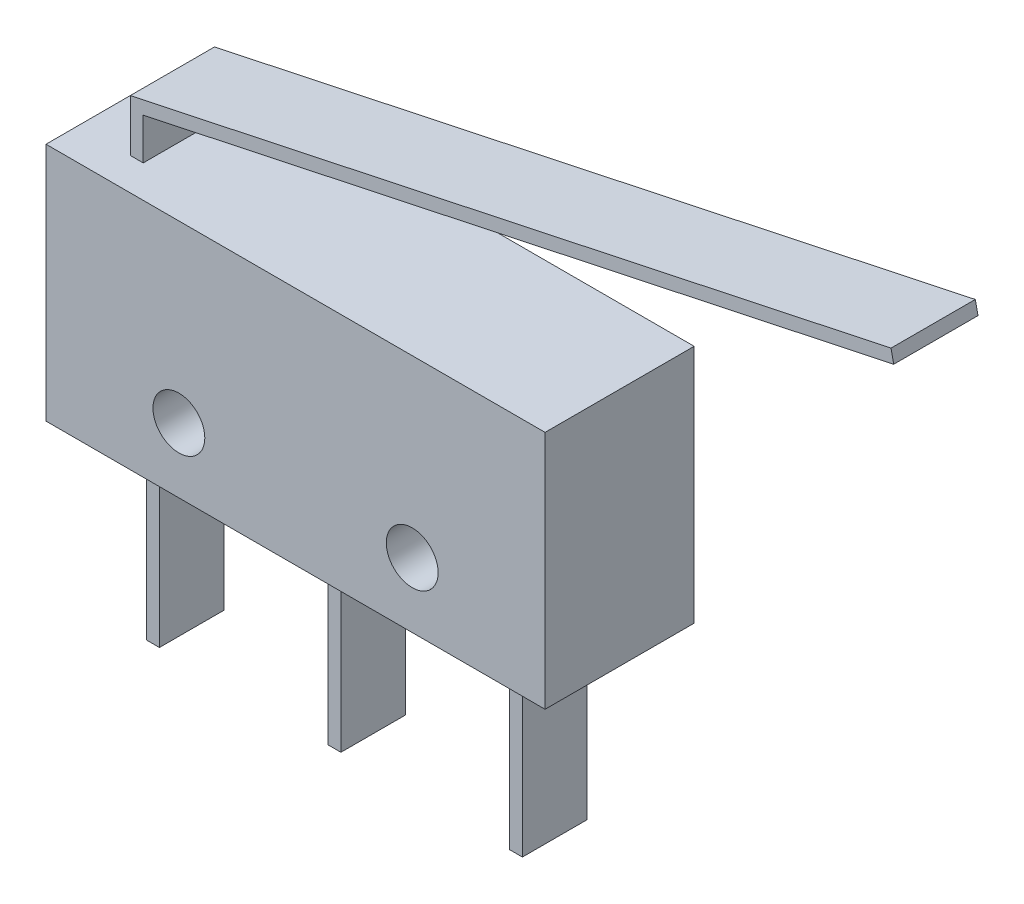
ISO-10303-21;
HEADER;
FILE_DESCRIPTION(('STEP AP214'),'2;1');
FILE_NAME('part.step','',(''),(''),'','','');
FILE_SCHEMA(('AUTOMOTIVE_DESIGN { 1 0 10303 214 1 1 1 1 }'));
ENDSEC;
DATA;
#1=APPLICATION_CONTEXT('core data for automotive mechanical design processes');
#2=APPLICATION_PROTOCOL_DEFINITION('international standard','automotive_design',2000,#1);
#3=PRODUCT_CONTEXT('',#1,'mechanical');
#4=PRODUCT('Part','Part','',(#3));
#5=PRODUCT_RELATED_PRODUCT_CATEGORY('part','',(#4));
#6=PRODUCT_DEFINITION_FORMATION('','',#4);
#7=PRODUCT_DEFINITION_CONTEXT('part definition',#1,'design');
#8=PRODUCT_DEFINITION('design','',#6,#7);
#9=PRODUCT_DEFINITION_SHAPE('','',#8);
#10=(LENGTH_UNIT() NAMED_UNIT(*) SI_UNIT(.MILLI.,.METRE.));
#11=(NAMED_UNIT(*) PLANE_ANGLE_UNIT() SI_UNIT($,.RADIAN.));
#12=(NAMED_UNIT(*) SI_UNIT($,.STERADIAN.) SOLID_ANGLE_UNIT());
#13=UNCERTAINTY_MEASURE_WITH_UNIT(LENGTH_MEASURE(1.E-05),#10,'distance_accuracy_value','');
#14=(GEOMETRIC_REPRESENTATION_CONTEXT(3) GLOBAL_UNCERTAINTY_ASSIGNED_CONTEXT((#13)) GLOBAL_UNIT_ASSIGNED_CONTEXT((#10,
#11,#12)) REPRESENTATION_CONTEXT('',''));
#15=CARTESIAN_POINT('',(0.,0.,0.));
#16=DIRECTION('',(0.,0.,1.));
#17=DIRECTION('',(1.,0.,0.));
#18=AXIS2_PLACEMENT_3D('',#15,#16,#17);
#19=CARTESIAN_POINT('',(-7.64138086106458,6.23410101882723,1.651));
#20=DIRECTION('',(-0.207911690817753,0.978147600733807,0.));
#21=DIRECTION('',(-0.978147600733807,-0.207911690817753,0.));
#22=AXIS2_PLACEMENT_3D('',#19,#20,#21);
#23=PLANE('',#22);
#24=DIRECTION('',(0.978147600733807,0.207911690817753,0.));
#25=VECTOR('',#24,1.);
#26=CARTESIAN_POINT('',(-7.64138086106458,6.23410101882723,-1.651));
#27=LINE('',#26,#25);
#28=CARTESIAN_POINT('',(-7.239,6.31962971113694,-1.651));
#29=VERTEX_POINT('',#28);
#30=CARTESIAN_POINT('',(22.1725580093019,12.5712493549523,-1.651));
#31=VERTEX_POINT('',#30);
#32=EDGE_CURVE('E124',#29,#31,#27,.T.);
#33=ORIENTED_EDGE('',*,*,#32,.T.);
#34=DIRECTION('',(0.,0.,-1.));
#35=VECTOR('',#34,1.);
#36=CARTESIAN_POINT('',(22.1725580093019,12.5712493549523,1.651));
#37=LINE('',#36,#35);
#38=CARTESIAN_POINT('',(22.1725580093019,12.5712493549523,1.651));
#39=VERTEX_POINT('',#38);
#40=EDGE_CURVE('E12',#39,#31,#37,.T.);
#41=ORIENTED_EDGE('',*,*,#40,.F.);
#42=DIRECTION('',(0.978147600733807,0.207911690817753,0.));
#43=VECTOR('',#42,1.);
#44=CARTESIAN_POINT('',(-7.64138086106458,6.23410101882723,1.651));
#45=LINE('',#44,#43);
#46=CARTESIAN_POINT('',(-7.239,6.31962971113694,1.651));
#47=VERTEX_POINT('',#46);
#48=EDGE_CURVE('E89',#47,#39,#45,.T.);
#49=ORIENTED_EDGE('',*,*,#48,.F.);
#50=DIRECTION('',(0.,0.,-1.));
#51=VECTOR('',#50,1.);
#52=CARTESIAN_POINT('',(-7.239,6.31962971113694,1.651));
#53=LINE('',#52,#51);
#54=EDGE_CURVE('E120',#47,#29,#53,.T.);
#55=ORIENTED_EDGE('',*,*,#54,.T.);
#56=EDGE_LOOP('',(#33,#41,#49,#55));
#57=FACE_BOUND('',#56,.T.);
#58=ADVANCED_FACE('F43',(#57),#23,.F.);
#59=CARTESIAN_POINT('',(22.0669388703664,13.0681483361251,1.651));
#60=DIRECTION('',(0.978147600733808,0.207911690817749,0.));
#61=DIRECTION('',(-0.207911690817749,0.978147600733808,0.));
#62=AXIS2_PLACEMENT_3D('',#59,#60,#61);
#63=PLANE('',#62);
#64=DIRECTION('',(0.207911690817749,-0.978147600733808,0.));
#65=VECTOR('',#64,1.);
#66=CARTESIAN_POINT('',(22.0669388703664,13.0681483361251,-1.651));
#67=LINE('',#66,#65);
#68=CARTESIAN_POINT('',(22.0669388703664,13.0681483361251,-1.651));
#69=VERTEX_POINT('',#68);
#70=EDGE_CURVE('E127',#69,#31,#67,.T.);
#71=ORIENTED_EDGE('',*,*,#70,.F.);
#72=DIRECTION('',(0.,0.,-1.));
#73=VECTOR('',#72,1.);
#74=CARTESIAN_POINT('',(22.0669388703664,13.0681483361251,1.651));
#75=LINE('',#74,#73);
#76=CARTESIAN_POINT('',(22.0669388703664,13.0681483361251,1.651));
#77=VERTEX_POINT('',#76);
#78=EDGE_CURVE('E51',#77,#69,#75,.T.);
#79=ORIENTED_EDGE('',*,*,#78,.F.);
#80=DIRECTION('',(0.207911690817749,-0.978147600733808,0.));
#81=VECTOR('',#80,1.);
#82=CARTESIAN_POINT('',(22.0669388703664,13.0681483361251,1.651));
#83=LINE('',#82,#81);
#84=EDGE_CURVE('E213',#77,#39,#83,.T.);
#85=ORIENTED_EDGE('',*,*,#84,.T.);
#86=ORIENTED_EDGE('',*,*,#40,.T.);
#87=EDGE_LOOP('',(#71,#79,#85,#86));
#88=FACE_BOUND('',#87,.T.);
#89=ADVANCED_FACE('F145',(#88),#63,.T.);
#90=CARTESIAN_POINT('',(-7.747,6.731,1.651));
#91=DIRECTION('',(-0.207911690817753,0.978147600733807,0.));
#92=DIRECTION('',(-0.978147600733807,-0.207911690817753,0.));
#93=AXIS2_PLACEMENT_3D('',#90,#91,#92);
#94=PLANE('',#93);
#95=DIRECTION('',(0.978147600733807,0.207911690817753,0.));
#96=VECTOR('',#95,1.);
#97=CARTESIAN_POINT('',(-7.747,6.731,-1.651));
#98=LINE('',#97,#96);
#99=CARTESIAN_POINT('',(-7.747,6.731,-1.651));
#100=VERTEX_POINT('',#99);
#101=EDGE_CURVE('E130',#100,#69,#98,.T.);
#102=ORIENTED_EDGE('',*,*,#101,.F.);
#103=DIRECTION('',(0.,0.,-1.));
#104=VECTOR('',#103,1.);
#105=CARTESIAN_POINT('',(-7.747,6.731,1.651));
#106=LINE('',#105,#104);
#107=CARTESIAN_POINT('',(-7.747,6.731,1.651));
#108=VERTEX_POINT('',#107);
#109=EDGE_CURVE('E110',#108,#100,#106,.T.);
#110=ORIENTED_EDGE('',*,*,#109,.F.);
#111=DIRECTION('',(0.978147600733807,0.207911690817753,0.));
#112=VECTOR('',#111,1.);
#113=CARTESIAN_POINT('',(-7.747,6.731,1.651));
#114=LINE('',#113,#112);
#115=EDGE_CURVE('E116',#108,#77,#114,.T.);
#116=ORIENTED_EDGE('',*,*,#115,.T.);
#117=ORIENTED_EDGE('',*,*,#78,.T.);
#118=EDGE_LOOP('',(#102,#110,#116,#117));
#119=FACE_BOUND('',#118,.T.);
#120=ADVANCED_FACE('F142',(#119),#94,.T.);
#121=CARTESIAN_POINT('',(-7.747,4.699,1.651));
#122=DIRECTION('',(-1.,0.,0.));
#123=DIRECTION('',(0.,-1.,0.));
#124=AXIS2_PLACEMENT_3D('',#121,#122,#123);
#125=PLANE('',#124);
#126=DIRECTION('',(0.,1.,0.));
#127=VECTOR('',#126,1.);
#128=CARTESIAN_POINT('',(-7.747,4.699,-1.651));
#129=LINE('',#128,#127);
#130=CARTESIAN_POINT('',(-7.747,4.699,-1.651));
#131=VERTEX_POINT('',#130);
#132=EDGE_CURVE('E105',#131,#100,#129,.T.);
#133=ORIENTED_EDGE('',*,*,#132,.F.);
#134=DIRECTION('',(0.,0.,-1.));
#135=VECTOR('',#134,1.);
#136=CARTESIAN_POINT('',(-7.747,4.699,1.651));
#137=LINE('',#136,#135);
#138=CARTESIAN_POINT('',(-7.747,4.699,1.651));
#139=VERTEX_POINT('',#138);
#140=EDGE_CURVE('E100',#139,#131,#137,.T.);
#141=ORIENTED_EDGE('',*,*,#140,.F.);
#142=DIRECTION('',(0.,1.,0.));
#143=VECTOR('',#142,1.);
#144=CARTESIAN_POINT('',(-7.747,4.699,1.651));
#145=LINE('',#144,#143);
#146=EDGE_CURVE('E103',#139,#108,#145,.T.);
#147=ORIENTED_EDGE('',*,*,#146,.T.);
#148=ORIENTED_EDGE('',*,*,#109,.T.);
#149=EDGE_LOOP('',(#133,#141,#147,#148));
#150=FACE_BOUND('',#149,.T.);
#151=ADVANCED_FACE('F102',(#150),#125,.T.);
#152=CARTESIAN_POINT('',(-7.239,4.699,1.651));
#153=DIRECTION('',(0.,-1.,0.));
#154=DIRECTION('',(0.,0.,-1.));
#155=AXIS2_PLACEMENT_3D('',#152,#153,#154);
#156=PLANE('',#155);
#157=DIRECTION('',(-1.,0.,0.));
#158=VECTOR('',#157,1.);
#159=CARTESIAN_POINT('',(-7.239,4.699,-1.651));
#160=LINE('',#159,#158);
#161=CARTESIAN_POINT('',(-7.239,4.699,-1.651));
#162=VERTEX_POINT('',#161);
#163=EDGE_CURVE('E134',#162,#131,#160,.T.);
#164=ORIENTED_EDGE('',*,*,#163,.F.);
#165=DIRECTION('',(0.,0.,-1.));
#166=VECTOR('',#165,1.);
#167=CARTESIAN_POINT('',(-7.239,4.699,1.651));
#168=LINE('',#167,#166);
#169=CARTESIAN_POINT('',(-7.239,4.699,1.651));
#170=VERTEX_POINT('',#169);
#171=EDGE_CURVE('E80',#170,#162,#168,.T.);
#172=ORIENTED_EDGE('',*,*,#171,.F.);
#173=DIRECTION('',(-1.,0.,0.));
#174=VECTOR('',#173,1.);
#175=CARTESIAN_POINT('',(-7.239,4.699,1.651));
#176=LINE('',#175,#174);
#177=EDGE_CURVE('E114',#170,#139,#176,.T.);
#178=ORIENTED_EDGE('',*,*,#177,.T.);
#179=ORIENTED_EDGE('',*,*,#140,.T.);
#180=EDGE_LOOP('',(#164,#172,#178,#179));
#181=FACE_BOUND('',#180,.T.);
#182=ADVANCED_FACE('F118',(#181),#156,.T.);
#183=CARTESIAN_POINT('',(-7.239,4.699,1.651));
#184=DIRECTION('',(-1.,0.,0.));
#185=DIRECTION('',(0.,-1.,0.));
#186=AXIS2_PLACEMENT_3D('',#183,#184,#185);
#187=PLANE('',#186);
#188=DIRECTION('',(0.,1.,0.));
#189=VECTOR('',#188,1.);
#190=CARTESIAN_POINT('',(-7.239,4.699,-1.651));
#191=LINE('',#190,#189);
#192=EDGE_CURVE('E83',#162,#29,#191,.T.);
#193=ORIENTED_EDGE('',*,*,#192,.T.);
#194=ORIENTED_EDGE('',*,*,#54,.F.);
#195=DIRECTION('',(0.,1.,0.));
#196=VECTOR('',#195,1.);
#197=CARTESIAN_POINT('',(-7.239,4.699,1.651));
#198=LINE('',#197,#196);
#199=EDGE_CURVE('E59',#170,#47,#198,.T.);
#200=ORIENTED_EDGE('',*,*,#199,.F.);
#201=ORIENTED_EDGE('',*,*,#171,.T.);
#202=EDGE_LOOP('',(#193,#194,#200,#201));
#203=FACE_BOUND('',#202,.T.);
#204=ADVANCED_FACE('F150',(#203),#187,.F.);
#205=CARTESIAN_POINT('',(0.,0.,1.651));
#206=DIRECTION('',(0.,0.,-1.));
#207=DIRECTION('',(-1.,0.,0.));
#208=AXIS2_PLACEMENT_3D('',#205,#206,#207);
#209=PLANE('',#208);
#210=ORIENTED_EDGE('',*,*,#48,.T.);
#211=ORIENTED_EDGE('',*,*,#84,.F.);
#212=ORIENTED_EDGE('',*,*,#115,.F.);
#213=ORIENTED_EDGE('',*,*,#146,.F.);
#214=ORIENTED_EDGE('',*,*,#177,.F.);
#215=ORIENTED_EDGE('',*,*,#199,.T.);
#216=EDGE_LOOP('',(#210,#211,#212,#213,#214,#215));
#217=FACE_BOUND('',#216,.T.);
#218=ADVANCED_FACE('F113',(#217),#209,.F.);
#219=CARTESIAN_POINT('',(0.,0.,-1.651));
#220=DIRECTION('',(0.,0.,-1.));
#221=DIRECTION('',(-1.,0.,0.));
#222=AXIS2_PLACEMENT_3D('',#219,#220,#221);
#223=PLANE('',#222);
#224=ORIENTED_EDGE('',*,*,#32,.F.);
#225=ORIENTED_EDGE('',*,*,#192,.F.);
#226=ORIENTED_EDGE('',*,*,#163,.T.);
#227=ORIENTED_EDGE('',*,*,#132,.T.);
#228=ORIENTED_EDGE('',*,*,#101,.T.);
#229=ORIENTED_EDGE('',*,*,#70,.T.);
#230=EDGE_LOOP('',(#224,#225,#226,#227,#228,#229));
#231=FACE_BOUND('',#230,.T.);
#232=ADVANCED_FACE('F148',(#231),#223,.T.);
#233=CLOSED_SHELL('',(#58,#89,#120,#151,#182,#204,#218,#232));
#234=MANIFOLD_SOLID_BREP('B2',#233);
#235=CARTESIAN_POINT('',(-9.779,-4.699,2.921));
#236=DIRECTION('',(1.,0.,0.));
#237=DIRECTION('',(0.,0.,-1.));
#238=AXIS2_PLACEMENT_3D('',#235,#236,#237);
#239=PLANE('',#238);
#240=DIRECTION('',(0.,-1.,0.));
#241=VECTOR('',#240,1.);
#242=CARTESIAN_POINT('',(-9.779,-4.699,-2.921));
#243=LINE('',#242,#241);
#244=CARTESIAN_POINT('',(-9.779,4.699,-2.921));
#245=VERTEX_POINT('',#244);
#246=CARTESIAN_POINT('',(-9.779,-4.699,-2.921));
#247=VERTEX_POINT('',#246);
#248=EDGE_CURVE('E429',#245,#247,#243,.T.);
#249=ORIENTED_EDGE('',*,*,#248,.T.);
#250=DIRECTION('',(0.,0.,-1.));
#251=VECTOR('',#250,1.);
#252=CARTESIAN_POINT('',(-9.779,-4.699,2.921));
#253=LINE('',#252,#251);
#254=CARTESIAN_POINT('',(-9.779,-4.699,2.921));
#255=VERTEX_POINT('',#254);
#256=EDGE_CURVE('E41',#255,#247,#253,.T.);
#257=ORIENTED_EDGE('',*,*,#256,.F.);
#258=DIRECTION('',(0.,-1.,0.));
#259=VECTOR('',#258,1.);
#260=CARTESIAN_POINT('',(-9.779,-4.699,2.921));
#261=LINE('',#260,#259);
#262=CARTESIAN_POINT('',(-9.779,4.699,2.921));
#263=VERTEX_POINT('',#262);
#264=EDGE_CURVE('E432',#263,#255,#261,.T.);
#265=ORIENTED_EDGE('',*,*,#264,.F.);
#266=DIRECTION('',(0.,0.,-1.));
#267=VECTOR('',#266,1.);
#268=CARTESIAN_POINT('',(-9.779,4.699,2.921));
#269=LINE('',#268,#267);
#270=EDGE_CURVE('E442',#263,#245,#269,.T.);
#271=ORIENTED_EDGE('',*,*,#270,.T.);
#272=EDGE_LOOP('',(#249,#257,#265,#271));
#273=FACE_BOUND('',#272,.T.);
#274=ADVANCED_FACE('F219',(#273),#239,.F.);
#275=CARTESIAN_POINT('',(9.779,-4.699,2.921));
#276=DIRECTION('',(0.,1.,0.));
#277=DIRECTION('',(-1.,0.,0.));
#278=AXIS2_PLACEMENT_3D('',#275,#276,#277);
#279=PLANE('',#278);
#280=DIRECTION('',(0.,0.,-1.));
#281=VECTOR('',#280,1.);
#282=CARTESIAN_POINT('',(6.731,-4.699,1.27));
#283=LINE('',#282,#281);
#284=CARTESIAN_POINT('',(6.731,-4.699,1.27));
#285=VERTEX_POINT('',#284);
#286=CARTESIAN_POINT('',(6.731,-4.699,-1.27));
#287=VERTEX_POINT('',#286);
#288=EDGE_CURVE('E233',#285,#287,#283,.T.);
#289=ORIENTED_EDGE('',*,*,#288,.F.);
#290=DIRECTION('',(-1.,0.,0.));
#291=VECTOR('',#290,1.);
#292=CARTESIAN_POINT('',(6.731,-4.699,1.27));
#293=LINE('',#292,#291);
#294=CARTESIAN_POINT('',(7.239,-4.699,1.27));
#295=VERTEX_POINT('',#294);
#296=EDGE_CURVE('E237',#295,#285,#293,.T.);
#297=ORIENTED_EDGE('',*,*,#296,.F.);
#298=DIRECTION('',(0.,0.,-1.));
#299=VECTOR('',#298,1.);
#300=CARTESIAN_POINT('',(7.239,-4.699,1.27));
#301=LINE('',#300,#299);
#302=CARTESIAN_POINT('',(7.239,-4.699,-1.27));
#303=VERTEX_POINT('',#302);
#304=EDGE_CURVE('E355',#295,#303,#301,.T.);
#305=ORIENTED_EDGE('',*,*,#304,.T.);
#306=DIRECTION('',(-1.,0.,0.));
#307=VECTOR('',#306,1.);
#308=CARTESIAN_POINT('',(6.731,-4.699,-1.27));
#309=LINE('',#308,#307);
#310=EDGE_CURVE('E345',#303,#287,#309,.T.);
#311=ORIENTED_EDGE('',*,*,#310,.T.);
#312=EDGE_LOOP('',(#289,#297,#305,#311));
#313=FACE_BOUND('',#312,.T.);
#314=DIRECTION('',(0.,0.,-1.));
#315=VECTOR('',#314,1.);
#316=CARTESIAN_POINT('',(-0.380999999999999,-4.699,1.27));
#317=LINE('',#316,#315);
#318=CARTESIAN_POINT('',(-0.380999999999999,-4.699,1.27));
#319=VERTEX_POINT('',#318);
#320=CARTESIAN_POINT('',(-0.380999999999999,-4.699,-1.27));
#321=VERTEX_POINT('',#320);
#322=EDGE_CURVE('E370',#319,#321,#317,.T.);
#323=ORIENTED_EDGE('',*,*,#322,.F.);
#324=DIRECTION('',(-1.,0.,0.));
#325=VECTOR('',#324,1.);
#326=CARTESIAN_POINT('',(-0.380999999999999,-4.699,1.27));
#327=LINE('',#326,#325);
#328=CARTESIAN_POINT('',(0.127,-4.699,1.27));
#329=VERTEX_POINT('',#328);
#330=EDGE_CURVE('E368',#329,#319,#327,.T.);
#331=ORIENTED_EDGE('',*,*,#330,.F.);
#332=DIRECTION('',(0.,0.,-1.));
#333=VECTOR('',#332,1.);
#334=CARTESIAN_POINT('',(0.127,-4.699,1.27));
#335=LINE('',#334,#333);
#336=CARTESIAN_POINT('',(0.127,-4.699,-1.27));
#337=VERTEX_POINT('',#336);
#338=EDGE_CURVE('E379',#329,#337,#335,.T.);
#339=ORIENTED_EDGE('',*,*,#338,.T.);
#340=DIRECTION('',(-1.,0.,0.));
#341=VECTOR('',#340,1.);
#342=CARTESIAN_POINT('',(-0.380999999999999,-4.699,-1.27));
#343=LINE('',#342,#341);
#344=EDGE_CURVE('E363',#337,#321,#343,.T.);
#345=ORIENTED_EDGE('',*,*,#344,.T.);
#346=EDGE_LOOP('',(#323,#331,#339,#345));
#347=FACE_BOUND('',#346,.T.);
#348=DIRECTION('',(0.,0.,-1.));
#349=VECTOR('',#348,1.);
#350=CARTESIAN_POINT('',(-7.493,-4.699,1.27));
#351=LINE('',#350,#349);
#352=CARTESIAN_POINT('',(-7.493,-4.699,1.27));
#353=VERTEX_POINT('',#352);
#354=CARTESIAN_POINT('',(-7.493,-4.699,-1.27));
#355=VERTEX_POINT('',#354);
#356=EDGE_CURVE('E400',#353,#355,#351,.T.);
#357=ORIENTED_EDGE('',*,*,#356,.F.);
#358=DIRECTION('',(-1.,0.,0.));
#359=VECTOR('',#358,1.);
#360=CARTESIAN_POINT('',(-7.493,-4.699,1.27));
#361=LINE('',#360,#359);
#362=CARTESIAN_POINT('',(-6.985,-4.699,1.27));
#363=VERTEX_POINT('',#362);
#364=EDGE_CURVE('E397',#363,#353,#361,.T.);
#365=ORIENTED_EDGE('',*,*,#364,.F.);
#366=DIRECTION('',(0.,0.,-1.));
#367=VECTOR('',#366,1.);
#368=CARTESIAN_POINT('',(-6.985,-4.699,1.27));
#369=LINE('',#368,#367);
#370=CARTESIAN_POINT('',(-6.985,-4.699,-1.27));
#371=VERTEX_POINT('',#370);
#372=EDGE_CURVE('E411',#363,#371,#369,.T.);
#373=ORIENTED_EDGE('',*,*,#372,.T.);
#374=DIRECTION('',(-1.,0.,0.));
#375=VECTOR('',#374,1.);
#376=CARTESIAN_POINT('',(-7.493,-4.699,-1.27));
#377=LINE('',#376,#375);
#378=EDGE_CURVE('E392',#371,#355,#377,.T.);
#379=ORIENTED_EDGE('',*,*,#378,.T.);
#380=EDGE_LOOP('',(#357,#365,#373,#379));
#381=FACE_BOUND('',#380,.T.);
#382=DIRECTION('',(1.,0.,0.));
#383=VECTOR('',#382,1.);
#384=CARTESIAN_POINT('',(9.779,-4.699,-2.921));
#385=LINE('',#384,#383);
#386=CARTESIAN_POINT('',(9.779,-4.699,-2.921));
#387=VERTEX_POINT('',#386);
#388=EDGE_CURVE('E445',#247,#387,#385,.T.);
#389=ORIENTED_EDGE('',*,*,#388,.T.);
#390=DIRECTION('',(0.,0.,-1.));
#391=VECTOR('',#390,1.);
#392=CARTESIAN_POINT('',(9.779,-4.699,2.921));
#393=LINE('',#392,#391);
#394=CARTESIAN_POINT('',(9.779,-4.699,2.921));
#395=VERTEX_POINT('',#394);
#396=EDGE_CURVE('E226',#395,#387,#393,.T.);
#397=ORIENTED_EDGE('',*,*,#396,.F.);
#398=DIRECTION('',(1.,0.,0.));
#399=VECTOR('',#398,1.);
#400=CARTESIAN_POINT('',(9.779,-4.699,2.921));
#401=LINE('',#400,#399);
#402=EDGE_CURVE('E435',#255,#395,#401,.T.);
#403=ORIENTED_EDGE('',*,*,#402,.F.);
#404=ORIENTED_EDGE('',*,*,#256,.T.);
#405=EDGE_LOOP('',(#389,#397,#403,#404));
#406=FACE_BOUND('',#405,.T.);
#407=ADVANCED_FACE('F475',(#313,#347,#381,#406),#279,.F.);
#408=CARTESIAN_POINT('',(9.779,-4.699,2.921));
#409=DIRECTION('',(-1.,0.,0.));
#410=DIRECTION('',(0.,0.,1.));
#411=AXIS2_PLACEMENT_3D('',#408,#409,#410);
#412=PLANE('',#411);
#413=DIRECTION('',(0.,1.,0.));
#414=VECTOR('',#413,1.);
#415=CARTESIAN_POINT('',(9.779,-4.699,-2.921));
#416=LINE('',#415,#414);
#417=CARTESIAN_POINT('',(9.779,4.699,-2.921));
#418=VERTEX_POINT('',#417);
#419=EDGE_CURVE('E447',#387,#418,#416,.T.);
#420=ORIENTED_EDGE('',*,*,#419,.T.);
#421=DIRECTION('',(0.,0.,-1.));
#422=VECTOR('',#421,1.);
#423=CARTESIAN_POINT('',(9.779,4.699,2.921));
#424=LINE('',#423,#422);
#425=CARTESIAN_POINT('',(9.779,4.699,2.921));
#426=VERTEX_POINT('',#425);
#427=EDGE_CURVE('E452',#426,#418,#424,.T.);
#428=ORIENTED_EDGE('',*,*,#427,.F.);
#429=DIRECTION('',(0.,1.,0.));
#430=VECTOR('',#429,1.);
#431=CARTESIAN_POINT('',(9.779,-4.699,2.921));
#432=LINE('',#431,#430);
#433=EDGE_CURVE('E438',#395,#426,#432,.T.);
#434=ORIENTED_EDGE('',*,*,#433,.F.);
#435=ORIENTED_EDGE('',*,*,#396,.T.);
#436=EDGE_LOOP('',(#420,#428,#434,#435));
#437=FACE_BOUND('',#436,.T.);
#438=ADVANCED_FACE('F459',(#437),#412,.F.);
#439=CARTESIAN_POINT('',(9.779,4.699,2.921));
#440=DIRECTION('',(0.,-1.,0.));
#441=DIRECTION('',(1.,0.,0.));
#442=AXIS2_PLACEMENT_3D('',#439,#440,#441);
#443=PLANE('',#442);
#444=DIRECTION('',(-1.,0.,0.));
#445=VECTOR('',#444,1.);
#446=CARTESIAN_POINT('',(9.779,4.699,-2.921));
#447=LINE('',#446,#445);
#448=EDGE_CURVE('E436',#418,#245,#447,.T.);
#449=ORIENTED_EDGE('',*,*,#448,.T.);
#450=ORIENTED_EDGE('',*,*,#270,.F.);
#451=DIRECTION('',(-1.,0.,0.));
#452=VECTOR('',#451,1.);
#453=CARTESIAN_POINT('',(9.779,4.699,2.921));
#454=LINE('',#453,#452);
#455=EDGE_CURVE('E440',#426,#263,#454,.T.);
#456=ORIENTED_EDGE('',*,*,#455,.F.);
#457=ORIENTED_EDGE('',*,*,#427,.T.);
#458=EDGE_LOOP('',(#449,#450,#456,#457));
#459=FACE_BOUND('',#458,.T.);
#460=ADVANCED_FACE('F468',(#459),#443,.F.);
#461=CARTESIAN_POINT('',(0.,0.,2.921));
#462=DIRECTION('',(0.,0.,1.));
#463=DIRECTION('',(1.,0.,0.));
#464=AXIS2_PLACEMENT_3D('',#461,#462,#463);
#465=PLANE('',#464);
#466=CARTESIAN_POINT('',(4.572,-2.159,2.921));
#467=DIRECTION('',(0.,0.,1.));
#468=DIRECTION('',(1.,0.,0.));
#469=AXIS2_PLACEMENT_3D('',#466,#467,#468);
#470=CIRCLE('',#469,1.016);
#471=CARTESIAN_POINT('',(5.588,-2.159,2.921));
#472=VERTEX_POINT('',#471);
#473=EDGE_CURVE('E419',#472,#472,#470,.T.);
#474=ORIENTED_EDGE('',*,*,#473,.F.);
#475=EDGE_LOOP('',(#474));
#476=FACE_BOUND('',#475,.T.);
#477=CARTESIAN_POINT('',(-4.572,-2.159,2.921));
#478=DIRECTION('',(0.,0.,1.));
#479=DIRECTION('',(1.,0.,0.));
#480=AXIS2_PLACEMENT_3D('',#477,#478,#479);
#481=CIRCLE('',#480,1.016);
#482=CARTESIAN_POINT('',(-3.556,-2.159,2.921));
#483=VERTEX_POINT('',#482);
#484=EDGE_CURVE('E423',#483,#483,#481,.T.);
#485=ORIENTED_EDGE('',*,*,#484,.F.);
#486=EDGE_LOOP('',(#485));
#487=FACE_BOUND('',#486,.T.);
#488=ORIENTED_EDGE('',*,*,#264,.T.);
#489=ORIENTED_EDGE('',*,*,#402,.T.);
#490=ORIENTED_EDGE('',*,*,#433,.T.);
#491=ORIENTED_EDGE('',*,*,#455,.T.);
#492=EDGE_LOOP('',(#488,#489,#490,#491));
#493=FACE_BOUND('',#492,.T.);
#494=ADVANCED_FACE('F474',(#476,#487,#493),#465,.T.);
#495=CARTESIAN_POINT('',(0.,0.,-2.921));
#496=DIRECTION('',(0.,0.,1.));
#497=DIRECTION('',(1.,0.,0.));
#498=AXIS2_PLACEMENT_3D('',#495,#496,#497);
#499=PLANE('',#498);
#500=CARTESIAN_POINT('',(4.572,-2.159,-2.921));
#501=DIRECTION('',(0.,0.,1.));
#502=DIRECTION('',(1.,0.,0.));
#503=AXIS2_PLACEMENT_3D('',#500,#501,#502);
#504=CIRCLE('',#503,1.016);
#505=CARTESIAN_POINT('',(5.588,-2.159,-2.921));
#506=VERTEX_POINT('',#505);
#507=EDGE_CURVE('E420',#506,#506,#504,.T.);
#508=ORIENTED_EDGE('',*,*,#507,.T.);
#509=EDGE_LOOP('',(#508));
#510=FACE_BOUND('',#509,.T.);
#511=CARTESIAN_POINT('',(-4.572,-2.159,-2.921));
#512=DIRECTION('',(0.,0.,1.));
#513=DIRECTION('',(1.,0.,0.));
#514=AXIS2_PLACEMENT_3D('',#511,#512,#513);
#515=CIRCLE('',#514,1.016);
#516=CARTESIAN_POINT('',(-3.556,-2.159,-2.921));
#517=VERTEX_POINT('',#516);
#518=EDGE_CURVE('E426',#517,#517,#515,.T.);
#519=ORIENTED_EDGE('',*,*,#518,.T.);
#520=EDGE_LOOP('',(#519));
#521=FACE_BOUND('',#520,.T.);
#522=ORIENTED_EDGE('',*,*,#248,.F.);
#523=ORIENTED_EDGE('',*,*,#448,.F.);
#524=ORIENTED_EDGE('',*,*,#419,.F.);
#525=ORIENTED_EDGE('',*,*,#388,.F.);
#526=EDGE_LOOP('',(#522,#523,#524,#525));
#527=FACE_BOUND('',#526,.T.);
#528=ADVANCED_FACE('F465',(#510,#521,#527),#499,.F.);
#529=CARTESIAN_POINT('',(-4.572,-2.159,-2.921));
#530=DIRECTION('',(0.,0.,1.));
#531=DIRECTION('',(1.,0.,0.));
#532=AXIS2_PLACEMENT_3D('',#529,#530,#531);
#533=CYLINDRICAL_SURFACE('',#532,1.016);
#534=ORIENTED_EDGE('',*,*,#518,.F.);
#535=EDGE_LOOP('',(#534));
#536=FACE_BOUND('',#535,.T.);
#537=ORIENTED_EDGE('',*,*,#484,.T.);
#538=EDGE_LOOP('',(#537));
#539=FACE_BOUND('',#538,.T.);
#540=ADVANCED_FACE('F488',(#536,#539),#533,.F.);
#541=CARTESIAN_POINT('',(4.572,-2.159,-2.921));
#542=DIRECTION('',(0.,0.,1.));
#543=DIRECTION('',(1.,0.,0.));
#544=AXIS2_PLACEMENT_3D('',#541,#542,#543);
#545=CYLINDRICAL_SURFACE('',#544,1.016);
#546=ORIENTED_EDGE('',*,*,#507,.F.);
#547=EDGE_LOOP('',(#546));
#548=FACE_BOUND('',#547,.T.);
#549=ORIENTED_EDGE('',*,*,#473,.T.);
#550=EDGE_LOOP('',(#549));
#551=FACE_BOUND('',#550,.T.);
#552=ADVANCED_FACE('F495',(#548,#551),#545,.F.);
#553=CARTESIAN_POINT('',(-7.493,-4.699,1.27));
#554=DIRECTION('',(1.,0.,0.));
#555=DIRECTION('',(0.,0.,-1.));
#556=AXIS2_PLACEMENT_3D('',#553,#554,#555);
#557=PLANE('',#556);
#558=DIRECTION('',(0.,-1.,0.));
#559=VECTOR('',#558,1.);
#560=CARTESIAN_POINT('',(-7.493,-4.699,-1.27));
#561=LINE('',#560,#559);
#562=CARTESIAN_POINT('',(-7.493,-11.811,-1.27));
#563=VERTEX_POINT('',#562);
#564=EDGE_CURVE('E387',#355,#563,#561,.T.);
#565=ORIENTED_EDGE('',*,*,#564,.T.);
#566=DIRECTION('',(0.,0.,-1.));
#567=VECTOR('',#566,1.);
#568=CARTESIAN_POINT('',(-7.493,-11.811,1.27));
#569=LINE('',#568,#567);
#570=CARTESIAN_POINT('',(-7.493,-11.811,1.27));
#571=VERTEX_POINT('',#570);
#572=EDGE_CURVE('E416',#571,#563,#569,.T.);
#573=ORIENTED_EDGE('',*,*,#572,.F.);
#574=DIRECTION('',(0.,-1.,0.));
#575=VECTOR('',#574,1.);
#576=CARTESIAN_POINT('',(-7.493,-4.699,1.27));
#577=LINE('',#576,#575);
#578=EDGE_CURVE('E388',#353,#571,#577,.T.);
#579=ORIENTED_EDGE('',*,*,#578,.F.);
#580=ORIENTED_EDGE('',*,*,#356,.T.);
#581=EDGE_LOOP('',(#565,#573,#579,#580));
#582=FACE_BOUND('',#581,.T.);
#583=ADVANCED_FACE('F499',(#582),#557,.F.);
#584=CARTESIAN_POINT('',(-7.493,-11.811,1.27));
#585=DIRECTION('',(0.,1.,0.));
#586=DIRECTION('',(0.,0.,1.));
#587=AXIS2_PLACEMENT_3D('',#584,#585,#586);
#588=PLANE('',#587);
#589=DIRECTION('',(1.,0.,0.));
#590=VECTOR('',#589,1.);
#591=CARTESIAN_POINT('',(-7.493,-11.811,-1.27));
#592=LINE('',#591,#590);
#593=CARTESIAN_POINT('',(-6.985,-11.811,-1.27));
#594=VERTEX_POINT('',#593);
#595=EDGE_CURVE('E403',#563,#594,#592,.T.);
#596=ORIENTED_EDGE('',*,*,#595,.T.);
#597=DIRECTION('',(0.,0.,-1.));
#598=VECTOR('',#597,1.);
#599=CARTESIAN_POINT('',(-6.985,-11.811,1.27));
#600=LINE('',#599,#598);
#601=CARTESIAN_POINT('',(-6.985,-11.811,1.27));
#602=VERTEX_POINT('',#601);
#603=EDGE_CURVE('E413',#602,#594,#600,.T.);
#604=ORIENTED_EDGE('',*,*,#603,.F.);
#605=DIRECTION('',(1.,0.,0.));
#606=VECTOR('',#605,1.);
#607=CARTESIAN_POINT('',(-7.493,-11.811,1.27));
#608=LINE('',#607,#606);
#609=EDGE_CURVE('E391',#571,#602,#608,.T.);
#610=ORIENTED_EDGE('',*,*,#609,.F.);
#611=ORIENTED_EDGE('',*,*,#572,.T.);
#612=EDGE_LOOP('',(#596,#604,#610,#611));
#613=FACE_BOUND('',#612,.T.);
#614=ADVANCED_FACE('F503',(#613),#588,.F.);
#615=CARTESIAN_POINT('',(-6.985,-4.699,1.27));
#616=DIRECTION('',(-1.,0.,0.));
#617=DIRECTION('',(0.,-1.,0.));
#618=AXIS2_PLACEMENT_3D('',#615,#616,#617);
#619=PLANE('',#618);
#620=DIRECTION('',(0.,1.,0.));
#621=VECTOR('',#620,1.);
#622=CARTESIAN_POINT('',(-6.985,-4.699,-1.27));
#623=LINE('',#622,#621);
#624=EDGE_CURVE('E405',#594,#371,#623,.T.);
#625=ORIENTED_EDGE('',*,*,#624,.T.);
#626=ORIENTED_EDGE('',*,*,#372,.F.);
#627=DIRECTION('',(0.,1.,0.));
#628=VECTOR('',#627,1.);
#629=CARTESIAN_POINT('',(-6.985,-4.699,1.27));
#630=LINE('',#629,#628);
#631=EDGE_CURVE('E394',#602,#363,#630,.T.);
#632=ORIENTED_EDGE('',*,*,#631,.F.);
#633=ORIENTED_EDGE('',*,*,#603,.T.);
#634=EDGE_LOOP('',(#625,#626,#632,#633));
#635=FACE_BOUND('',#634,.T.);
#636=ADVANCED_FACE('F507',(#635),#619,.F.);
#637=CARTESIAN_POINT('',(0.,0.,1.27));
#638=DIRECTION('',(0.,0.,1.));
#639=DIRECTION('',(1.,0.,0.));
#640=AXIS2_PLACEMENT_3D('',#637,#638,#639);
#641=PLANE('',#640);
#642=ORIENTED_EDGE('',*,*,#578,.T.);
#643=ORIENTED_EDGE('',*,*,#609,.T.);
#644=ORIENTED_EDGE('',*,*,#631,.T.);
#645=ORIENTED_EDGE('',*,*,#364,.T.);
#646=EDGE_LOOP('',(#642,#643,#644,#645));
#647=FACE_BOUND('',#646,.T.);
#648=ADVANCED_FACE('F511',(#647),#641,.T.);
#649=CARTESIAN_POINT('',(0.,0.,-1.27));
#650=DIRECTION('',(0.,0.,1.));
#651=DIRECTION('',(1.,0.,0.));
#652=AXIS2_PLACEMENT_3D('',#649,#650,#651);
#653=PLANE('',#652);
#654=ORIENTED_EDGE('',*,*,#564,.F.);
#655=ORIENTED_EDGE('',*,*,#378,.F.);
#656=ORIENTED_EDGE('',*,*,#624,.F.);
#657=ORIENTED_EDGE('',*,*,#595,.F.);
#658=EDGE_LOOP('',(#654,#655,#656,#657));
#659=FACE_BOUND('',#658,.T.);
#660=ADVANCED_FACE('F513',(#659),#653,.F.);
#661=CARTESIAN_POINT('',(-0.380999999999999,-4.699,1.27));
#662=DIRECTION('',(1.,0.,0.));
#663=DIRECTION('',(0.,1.,0.));
#664=AXIS2_PLACEMENT_3D('',#661,#662,#663);
#665=PLANE('',#664);
#666=DIRECTION('',(0.,-1.,0.));
#667=VECTOR('',#666,1.);
#668=CARTESIAN_POINT('',(-0.380999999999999,-4.699,-1.27));
#669=LINE('',#668,#667);
#670=CARTESIAN_POINT('',(-0.380999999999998,-11.811,-1.27));
#671=VERTEX_POINT('',#670);
#672=EDGE_CURVE('E350',#321,#671,#669,.T.);
#673=ORIENTED_EDGE('',*,*,#672,.T.);
#674=DIRECTION('',(0.,0.,-1.));
#675=VECTOR('',#674,1.);
#676=CARTESIAN_POINT('',(-0.380999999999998,-11.811,1.27));
#677=LINE('',#676,#675);
#678=CARTESIAN_POINT('',(-0.380999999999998,-11.811,1.27));
#679=VERTEX_POINT('',#678);
#680=EDGE_CURVE('E384',#679,#671,#677,.T.);
#681=ORIENTED_EDGE('',*,*,#680,.F.);
#682=DIRECTION('',(0.,-1.,0.));
#683=VECTOR('',#682,1.);
#684=CARTESIAN_POINT('',(-0.380999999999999,-4.699,1.27));
#685=LINE('',#684,#683);
#686=EDGE_CURVE('E359',#319,#679,#685,.T.);
#687=ORIENTED_EDGE('',*,*,#686,.F.);
#688=ORIENTED_EDGE('',*,*,#322,.T.);
#689=EDGE_LOOP('',(#673,#681,#687,#688));
#690=FACE_BOUND('',#689,.T.);
#691=ADVANCED_FACE('F516',(#690),#665,.F.);
#692=CARTESIAN_POINT('',(-0.380999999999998,-11.811,1.27));
#693=DIRECTION('',(0.,1.,0.));
#694=DIRECTION('',(0.,0.,1.));
#695=AXIS2_PLACEMENT_3D('',#692,#693,#694);
#696=PLANE('',#695);
#697=DIRECTION('',(1.,0.,0.));
#698=VECTOR('',#697,1.);
#699=CARTESIAN_POINT('',(-0.380999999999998,-11.811,-1.27));
#700=LINE('',#699,#698);
#701=CARTESIAN_POINT('',(0.127,-11.811,-1.27));
#702=VERTEX_POINT('',#701);
#703=EDGE_CURVE('E353',#671,#702,#700,.T.);
#704=ORIENTED_EDGE('',*,*,#703,.T.);
#705=DIRECTION('',(0.,0.,-1.));
#706=VECTOR('',#705,1.);
#707=CARTESIAN_POINT('',(0.127,-11.811,1.27));
#708=LINE('',#707,#706);
#709=CARTESIAN_POINT('',(0.127,-11.811,1.27));
#710=VERTEX_POINT('',#709);
#711=EDGE_CURVE('E381',#710,#702,#708,.T.);
#712=ORIENTED_EDGE('',*,*,#711,.F.);
#713=DIRECTION('',(1.,0.,0.));
#714=VECTOR('',#713,1.);
#715=CARTESIAN_POINT('',(-0.380999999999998,-11.811,1.27));
#716=LINE('',#715,#714);
#717=EDGE_CURVE('E362',#679,#710,#716,.T.);
#718=ORIENTED_EDGE('',*,*,#717,.F.);
#719=ORIENTED_EDGE('',*,*,#680,.T.);
#720=EDGE_LOOP('',(#704,#712,#718,#719));
#721=FACE_BOUND('',#720,.T.);
#722=ADVANCED_FACE('F523',(#721),#696,.F.);
#723=CARTESIAN_POINT('',(0.127,-4.699,1.27));
#724=DIRECTION('',(-1.,0.,0.));
#725=DIRECTION('',(0.,-1.,0.));
#726=AXIS2_PLACEMENT_3D('',#723,#724,#725);
#727=PLANE('',#726);
#728=DIRECTION('',(0.,1.,0.));
#729=VECTOR('',#728,1.);
#730=CARTESIAN_POINT('',(0.127,-4.699,-1.27));
#731=LINE('',#730,#729);
#732=EDGE_CURVE('E373',#702,#337,#731,.T.);
#733=ORIENTED_EDGE('',*,*,#732,.T.);
#734=ORIENTED_EDGE('',*,*,#338,.F.);
#735=DIRECTION('',(0.,1.,0.));
#736=VECTOR('',#735,1.);
#737=CARTESIAN_POINT('',(0.127,-4.699,1.27));
#738=LINE('',#737,#736);
#739=EDGE_CURVE('E365',#710,#329,#738,.T.);
#740=ORIENTED_EDGE('',*,*,#739,.F.);
#741=ORIENTED_EDGE('',*,*,#711,.T.);
#742=EDGE_LOOP('',(#733,#734,#740,#741));
#743=FACE_BOUND('',#742,.T.);
#744=ADVANCED_FACE('F527',(#743),#727,.F.);
#745=CARTESIAN_POINT('',(0.,0.,1.27));
#746=DIRECTION('',(0.,0.,1.));
#747=DIRECTION('',(1.,0.,0.));
#748=AXIS2_PLACEMENT_3D('',#745,#746,#747);
#749=PLANE('',#748);
#750=ORIENTED_EDGE('',*,*,#686,.T.);
#751=ORIENTED_EDGE('',*,*,#717,.T.);
#752=ORIENTED_EDGE('',*,*,#739,.T.);
#753=ORIENTED_EDGE('',*,*,#330,.T.);
#754=EDGE_LOOP('',(#750,#751,#752,#753));
#755=FACE_BOUND('',#754,.T.);
#756=ADVANCED_FACE('F531',(#755),#749,.T.);
#757=CARTESIAN_POINT('',(0.,0.,-1.27));
#758=DIRECTION('',(0.,0.,1.));
#759=DIRECTION('',(1.,0.,0.));
#760=AXIS2_PLACEMENT_3D('',#757,#758,#759);
#761=PLANE('',#760);
#762=ORIENTED_EDGE('',*,*,#672,.F.);
#763=ORIENTED_EDGE('',*,*,#344,.F.);
#764=ORIENTED_EDGE('',*,*,#732,.F.);
#765=ORIENTED_EDGE('',*,*,#703,.F.);
#766=EDGE_LOOP('',(#762,#763,#764,#765));
#767=FACE_BOUND('',#766,.T.);
#768=ADVANCED_FACE('F533',(#767),#761,.F.);
#769=CARTESIAN_POINT('',(6.731,-4.699,1.27));
#770=DIRECTION('',(1.,0.,0.));
#771=DIRECTION('',(0.,1.,0.));
#772=AXIS2_PLACEMENT_3D('',#769,#770,#771);
#773=PLANE('',#772);
#774=DIRECTION('',(0.,-1.,0.));
#775=VECTOR('',#774,1.);
#776=CARTESIAN_POINT('',(6.731,-4.699,-1.27));
#777=LINE('',#776,#775);
#778=CARTESIAN_POINT('',(6.731,-11.811,-1.27));
#779=VERTEX_POINT('',#778);
#780=EDGE_CURVE('E349',#287,#779,#777,.T.);
#781=ORIENTED_EDGE('',*,*,#780,.T.);
#782=DIRECTION('',(0.,0.,-1.));
#783=VECTOR('',#782,1.);
#784=CARTESIAN_POINT('',(6.731,-11.811,1.27));
#785=LINE('',#784,#783);
#786=CARTESIAN_POINT('',(6.731,-11.811,1.27));
#787=VERTEX_POINT('',#786);
#788=EDGE_CURVE('E333',#787,#779,#785,.T.);
#789=ORIENTED_EDGE('',*,*,#788,.F.);
#790=DIRECTION('',(0.,-1.,0.));
#791=VECTOR('',#790,1.);
#792=CARTESIAN_POINT('',(6.731,-4.699,1.27));
#793=LINE('',#792,#791);
#794=EDGE_CURVE('E340',#285,#787,#793,.T.);
#795=ORIENTED_EDGE('',*,*,#794,.F.);
#796=ORIENTED_EDGE('',*,*,#288,.T.);
#797=EDGE_LOOP('',(#781,#789,#795,#796));
#798=FACE_BOUND('',#797,.T.);
#799=ADVANCED_FACE('F347',(#798),#773,.F.);
#800=CARTESIAN_POINT('',(6.731,-11.811,1.27));
#801=DIRECTION('',(0.,1.,0.));
#802=DIRECTION('',(0.,0.,1.));
#803=AXIS2_PLACEMENT_3D('',#800,#801,#802);
#804=PLANE('',#803);
#805=DIRECTION('',(1.,0.,0.));
#806=VECTOR('',#805,1.);
#807=CARTESIAN_POINT('',(6.731,-11.811,-1.27));
#808=LINE('',#807,#806);
#809=CARTESIAN_POINT('',(7.239,-11.811,-1.27));
#810=VERTEX_POINT('',#809);
#811=EDGE_CURVE('E691',#779,#810,#808,.T.);
#812=ORIENTED_EDGE('',*,*,#811,.T.);
#813=DIRECTION('',(0.,0.,-1.));
#814=VECTOR('',#813,1.);
#815=CARTESIAN_POINT('',(7.239,-11.811,1.27));
#816=LINE('',#815,#814);
#817=CARTESIAN_POINT('',(7.239,-11.811,1.27));
#818=VERTEX_POINT('',#817);
#819=EDGE_CURVE('E336',#818,#810,#816,.T.);
#820=ORIENTED_EDGE('',*,*,#819,.F.);
#821=DIRECTION('',(1.,0.,0.));
#822=VECTOR('',#821,1.);
#823=CARTESIAN_POINT('',(6.731,-11.811,1.27));
#824=LINE('',#823,#822);
#825=EDGE_CURVE('E329',#787,#818,#824,.T.);
#826=ORIENTED_EDGE('',*,*,#825,.F.);
#827=ORIENTED_EDGE('',*,*,#788,.T.);
#828=EDGE_LOOP('',(#812,#820,#826,#827));
#829=FACE_BOUND('',#828,.T.);
#830=ADVANCED_FACE('F331',(#829),#804,.F.);
#831=CARTESIAN_POINT('',(7.239,-4.699,1.27));
#832=DIRECTION('',(-1.,0.,0.));
#833=DIRECTION('',(0.,-1.,0.));
#834=AXIS2_PLACEMENT_3D('',#831,#832,#833);
#835=PLANE('',#834);
#836=DIRECTION('',(0.,1.,0.));
#837=VECTOR('',#836,1.);
#838=CARTESIAN_POINT('',(7.239,-4.699,-1.27));
#839=LINE('',#838,#837);
#840=EDGE_CURVE('E693',#810,#303,#839,.T.);
#841=ORIENTED_EDGE('',*,*,#840,.T.);
#842=ORIENTED_EDGE('',*,*,#304,.F.);
#843=DIRECTION('',(0.,1.,0.));
#844=VECTOR('',#843,1.);
#845=CARTESIAN_POINT('',(7.239,-4.699,1.27));
#846=LINE('',#845,#844);
#847=EDGE_CURVE('E339',#818,#295,#846,.T.);
#848=ORIENTED_EDGE('',*,*,#847,.F.);
#849=ORIENTED_EDGE('',*,*,#819,.T.);
#850=EDGE_LOOP('',(#841,#842,#848,#849));
#851=FACE_BOUND('',#850,.T.);
#852=ADVANCED_FACE('F544',(#851),#835,.F.);
#853=CARTESIAN_POINT('',(0.,0.,1.27));
#854=DIRECTION('',(0.,0.,1.));
#855=DIRECTION('',(1.,0.,0.));
#856=AXIS2_PLACEMENT_3D('',#853,#854,#855);
#857=PLANE('',#856);
#858=ORIENTED_EDGE('',*,*,#794,.T.);
#859=ORIENTED_EDGE('',*,*,#825,.T.);
#860=ORIENTED_EDGE('',*,*,#847,.T.);
#861=ORIENTED_EDGE('',*,*,#296,.T.);
#862=EDGE_LOOP('',(#858,#859,#860,#861));
#863=FACE_BOUND('',#862,.T.);
#864=ADVANCED_FACE('F343',(#863),#857,.T.);
#865=CARTESIAN_POINT('',(0.,0.,-1.27));
#866=DIRECTION('',(0.,0.,1.));
#867=DIRECTION('',(1.,0.,0.));
#868=AXIS2_PLACEMENT_3D('',#865,#866,#867);
#869=PLANE('',#868);
#870=ORIENTED_EDGE('',*,*,#780,.F.);
#871=ORIENTED_EDGE('',*,*,#310,.F.);
#872=ORIENTED_EDGE('',*,*,#840,.F.);
#873=ORIENTED_EDGE('',*,*,#811,.F.);
#874=EDGE_LOOP('',(#870,#871,#872,#873));
#875=FACE_BOUND('',#874,.T.);
#876=ADVANCED_FACE('F548',(#875),#869,.F.);
#877=CLOSED_SHELL('',(#274,#407,#438,#460,#494,#528,#540,#552,#583,#614,#636,#648,#660,#691,
#722,#744,#756,#768,#799,#830,#852,#864,#876));
#878=MANIFOLD_SOLID_BREP('B6',#877);
#879=ADVANCED_BREP_SHAPE_REPRESENTATION('',(#18,#234,#878),#14);
#880=SHAPE_DEFINITION_REPRESENTATION(#9,#879);
ENDSEC;
END-ISO-10303-21;
